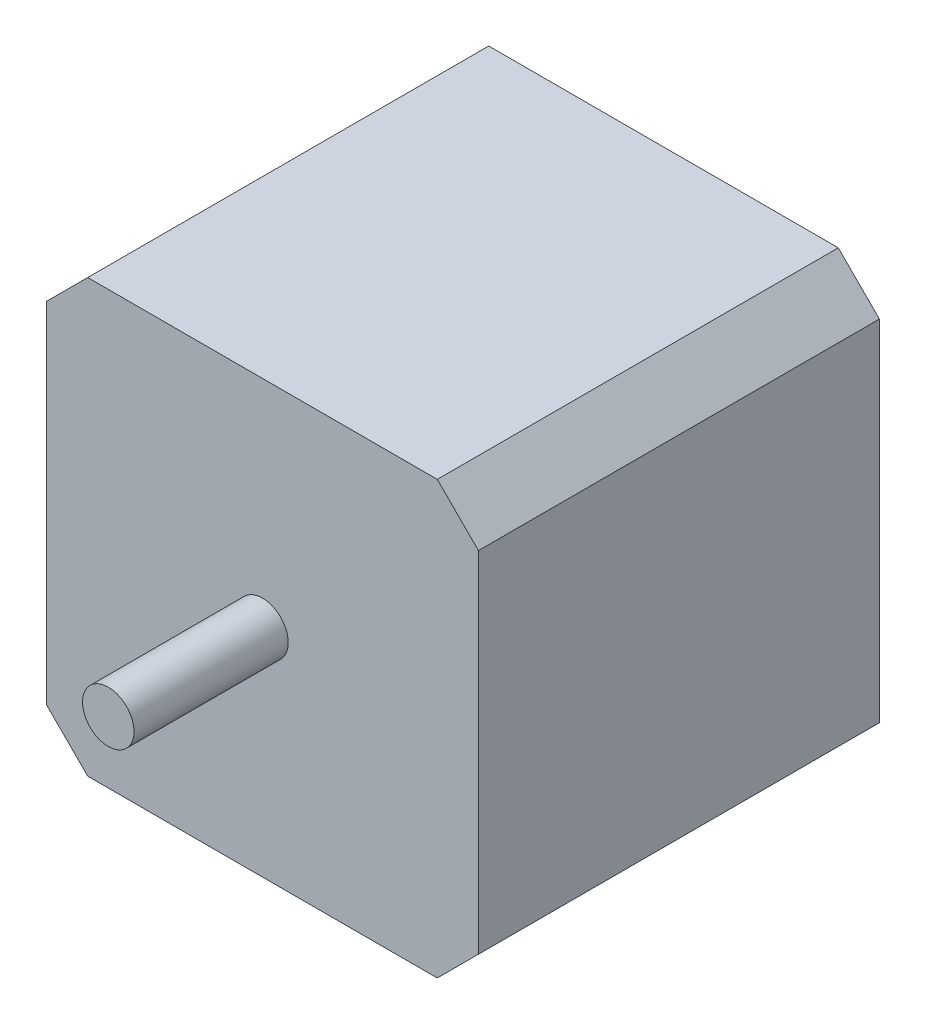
ISO-10303-21;
HEADER;
FILE_DESCRIPTION(('STEP AP214'),'2;1');
FILE_NAME('part.step','',(''),(''),'','','');
FILE_SCHEMA(('AUTOMOTIVE_DESIGN { 1 0 10303 214 1 1 1 1 }'));
ENDSEC;
DATA;
#1=APPLICATION_CONTEXT('core data for automotive mechanical design processes');
#2=APPLICATION_PROTOCOL_DEFINITION('international standard','automotive_design',2000,#1);
#3=PRODUCT_CONTEXT('',#1,'mechanical');
#4=PRODUCT('Part','Part','',(#3));
#5=PRODUCT_RELATED_PRODUCT_CATEGORY('part','',(#4));
#6=PRODUCT_DEFINITION_FORMATION('','',#4);
#7=PRODUCT_DEFINITION_CONTEXT('part definition',#1,'design');
#8=PRODUCT_DEFINITION('design','',#6,#7);
#9=PRODUCT_DEFINITION_SHAPE('','',#8);
#10=(LENGTH_UNIT() NAMED_UNIT(*) SI_UNIT(.MILLI.,.METRE.));
#11=(NAMED_UNIT(*) PLANE_ANGLE_UNIT() SI_UNIT($,.RADIAN.));
#12=(NAMED_UNIT(*) SI_UNIT($,.STERADIAN.) SOLID_ANGLE_UNIT());
#13=UNCERTAINTY_MEASURE_WITH_UNIT(LENGTH_MEASURE(1.E-05),#10,'distance_accuracy_value','');
#14=(GEOMETRIC_REPRESENTATION_CONTEXT(3) GLOBAL_UNCERTAINTY_ASSIGNED_CONTEXT((#13)) GLOBAL_UNIT_ASSIGNED_CONTEXT((#10,
#11,#12)) REPRESENTATION_CONTEXT('',''));
#15=CARTESIAN_POINT('',(0.,0.,0.));
#16=DIRECTION('',(0.,0.,1.));
#17=DIRECTION('',(1.,0.,0.));
#18=AXIS2_PLACEMENT_3D('',#15,#16,#17);
#19=CARTESIAN_POINT('',(0.,0.,39.));
#20=DIRECTION('',(1.,0.,0.));
#21=DIRECTION('',(0.,0.,-1.));
#22=AXIS2_PLACEMENT_3D('',#19,#20,#21);
#23=PLANE('',#22);
#24=DIRECTION('',(0.,-1.,0.));
#25=VECTOR('',#24,1.);
#26=CARTESIAN_POINT('',(0.,0.,0.));
#27=LINE('',#26,#25);
#28=CARTESIAN_POINT('',(0.,38.,0.));
#29=VERTEX_POINT('',#28);
#30=CARTESIAN_POINT('',(0.,4.00000000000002,0.));
#31=VERTEX_POINT('',#30);
#32=EDGE_CURVE('E140',#29,#31,#27,.T.);
#33=ORIENTED_EDGE('',*,*,#32,.T.);
#34=DIRECTION('',(0.,0.,1.));
#35=VECTOR('',#34,1.);
#36=CARTESIAN_POINT('',(0.,4.00000000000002,39.));
#37=LINE('',#36,#35);
#38=CARTESIAN_POINT('',(0.,4.00000000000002,39.));
#39=VERTEX_POINT('',#38);
#40=EDGE_CURVE('E178',#31,#39,#37,.T.);
#41=ORIENTED_EDGE('',*,*,#40,.T.);
#42=DIRECTION('',(0.,-1.,0.));
#43=VECTOR('',#42,1.);
#44=CARTESIAN_POINT('',(0.,0.,39.));
#45=LINE('',#44,#43);
#46=CARTESIAN_POINT('',(0.,38.,39.));
#47=VERTEX_POINT('',#46);
#48=EDGE_CURVE('E138',#47,#39,#45,.T.);
#49=ORIENTED_EDGE('',*,*,#48,.F.);
#50=DIRECTION('',(0.,0.,-1.));
#51=VECTOR('',#50,1.);
#52=CARTESIAN_POINT('',(0.,38.,39.));
#53=LINE('',#52,#51);
#54=EDGE_CURVE('E174',#47,#29,#53,.T.);
#55=ORIENTED_EDGE('',*,*,#54,.T.);
#56=EDGE_LOOP('',(#33,#41,#49,#55));
#57=FACE_BOUND('',#56,.T.);
#58=ADVANCED_FACE('F39',(#57),#23,.F.);
#59=CARTESIAN_POINT('',(0.,0.,39.));
#60=DIRECTION('',(0.,1.,0.));
#61=DIRECTION('',(0.,0.,1.));
#62=AXIS2_PLACEMENT_3D('',#59,#60,#61);
#63=PLANE('',#62);
#64=DIRECTION('',(1.,0.,0.));
#65=VECTOR('',#64,1.);
#66=CARTESIAN_POINT('',(0.,0.,0.));
#67=LINE('',#66,#65);
#68=CARTESIAN_POINT('',(4.,0.,0.));
#69=VERTEX_POINT('',#68);
#70=CARTESIAN_POINT('',(38.,0.,0.));
#71=VERTEX_POINT('',#70);
#72=EDGE_CURVE('E134',#69,#71,#67,.T.);
#73=ORIENTED_EDGE('',*,*,#72,.T.);
#74=DIRECTION('',(0.,0.,1.));
#75=VECTOR('',#74,1.);
#76=CARTESIAN_POINT('',(38.,0.,39.));
#77=LINE('',#76,#75);
#78=CARTESIAN_POINT('',(38.,0.,39.));
#79=VERTEX_POINT('',#78);
#80=EDGE_CURVE('E110',#71,#79,#77,.T.);
#81=ORIENTED_EDGE('',*,*,#80,.T.);
#82=DIRECTION('',(1.,0.,0.));
#83=VECTOR('',#82,1.);
#84=CARTESIAN_POINT('',(0.,0.,39.));
#85=LINE('',#84,#83);
#86=CARTESIAN_POINT('',(4.,0.,39.));
#87=VERTEX_POINT('',#86);
#88=EDGE_CURVE('E197',#87,#79,#85,.T.);
#89=ORIENTED_EDGE('',*,*,#88,.F.);
#90=DIRECTION('',(0.,0.,-1.));
#91=VECTOR('',#90,1.);
#92=CARTESIAN_POINT('',(4.,0.,39.));
#93=LINE('',#92,#91);
#94=EDGE_CURVE('E116',#87,#69,#93,.T.);
#95=ORIENTED_EDGE('',*,*,#94,.T.);
#96=EDGE_LOOP('',(#73,#81,#89,#95));
#97=FACE_BOUND('',#96,.T.);
#98=ADVANCED_FACE('F227',(#97),#63,.F.);
#99=CARTESIAN_POINT('',(42.,0.,39.));
#100=DIRECTION('',(-1.,0.,0.));
#101=DIRECTION('',(0.,0.,1.));
#102=AXIS2_PLACEMENT_3D('',#99,#100,#101);
#103=PLANE('',#102);
#104=DIRECTION('',(0.,1.,0.));
#105=VECTOR('',#104,1.);
#106=CARTESIAN_POINT('',(42.,0.,39.));
#107=LINE('',#106,#105);
#108=CARTESIAN_POINT('',(42.,4.,39.));
#109=VERTEX_POINT('',#108);
#110=CARTESIAN_POINT('',(42.,38.,39.));
#111=VERTEX_POINT('',#110);
#112=EDGE_CURVE('E125',#109,#111,#107,.T.);
#113=ORIENTED_EDGE('',*,*,#112,.F.);
#114=DIRECTION('',(0.,0.,-1.));
#115=VECTOR('',#114,1.);
#116=CARTESIAN_POINT('',(42.,4.,39.));
#117=LINE('',#116,#115);
#118=CARTESIAN_POINT('',(42.,4.,0.));
#119=VERTEX_POINT('',#118);
#120=EDGE_CURVE('E109',#109,#119,#117,.T.);
#121=ORIENTED_EDGE('',*,*,#120,.T.);
#122=DIRECTION('',(0.,1.,0.));
#123=VECTOR('',#122,1.);
#124=CARTESIAN_POINT('',(42.,0.,0.));
#125=LINE('',#124,#123);
#126=CARTESIAN_POINT('',(42.,38.,0.));
#127=VERTEX_POINT('',#126);
#128=EDGE_CURVE('E123',#119,#127,#125,.T.);
#129=ORIENTED_EDGE('',*,*,#128,.T.);
#130=DIRECTION('',(0.,0.,1.));
#131=VECTOR('',#130,1.);
#132=CARTESIAN_POINT('',(42.,38.,39.));
#133=LINE('',#132,#131);
#134=EDGE_CURVE('E128',#127,#111,#133,.T.);
#135=ORIENTED_EDGE('',*,*,#134,.T.);
#136=EDGE_LOOP('',(#113,#121,#129,#135));
#137=FACE_BOUND('',#136,.T.);
#138=ADVANCED_FACE('F122',(#137),#103,.F.);
#139=CARTESIAN_POINT('',(0.,42.,39.));
#140=DIRECTION('',(0.,-1.,0.));
#141=DIRECTION('',(0.,0.,-1.));
#142=AXIS2_PLACEMENT_3D('',#139,#140,#141);
#143=PLANE('',#142);
#144=DIRECTION('',(-1.,0.,0.));
#145=VECTOR('',#144,1.);
#146=CARTESIAN_POINT('',(0.,42.,0.));
#147=LINE('',#146,#145);
#148=CARTESIAN_POINT('',(38.,42.,0.));
#149=VERTEX_POINT('',#148);
#150=CARTESIAN_POINT('',(4.00000000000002,42.,0.));
#151=VERTEX_POINT('',#150);
#152=EDGE_CURVE('E133',#149,#151,#147,.T.);
#153=ORIENTED_EDGE('',*,*,#152,.T.);
#154=DIRECTION('',(0.,0.,1.));
#155=VECTOR('',#154,1.);
#156=CARTESIAN_POINT('',(4.00000000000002,42.,39.));
#157=LINE('',#156,#155);
#158=CARTESIAN_POINT('',(4.00000000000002,42.,39.));
#159=VERTEX_POINT('',#158);
#160=EDGE_CURVE('E11',#151,#159,#157,.T.);
#161=ORIENTED_EDGE('',*,*,#160,.T.);
#162=DIRECTION('',(-1.,0.,0.));
#163=VECTOR('',#162,1.);
#164=CARTESIAN_POINT('',(0.,42.,39.));
#165=LINE('',#164,#163);
#166=CARTESIAN_POINT('',(38.,42.,39.));
#167=VERTEX_POINT('',#166);
#168=EDGE_CURVE('E148',#167,#159,#165,.T.);
#169=ORIENTED_EDGE('',*,*,#168,.F.);
#170=DIRECTION('',(0.,0.,-1.));
#171=VECTOR('',#170,1.);
#172=CARTESIAN_POINT('',(38.,42.,39.));
#173=LINE('',#172,#171);
#174=EDGE_CURVE('E48',#167,#149,#173,.T.);
#175=ORIENTED_EDGE('',*,*,#174,.T.);
#176=EDGE_LOOP('',(#153,#161,#169,#175));
#177=FACE_BOUND('',#176,.T.);
#178=ADVANCED_FACE('F183',(#177),#143,.F.);
#179=CARTESIAN_POINT('',(0.,0.,39.));
#180=DIRECTION('',(0.,0.,-1.));
#181=DIRECTION('',(-1.,0.,0.));
#182=AXIS2_PLACEMENT_3D('',#179,#180,#181);
#183=PLANE('',#182);
#184=CARTESIAN_POINT('',(21.,21.,39.));
#185=DIRECTION('',(0.,0.,-1.));
#186=DIRECTION('',(-1.,0.,0.));
#187=AXIS2_PLACEMENT_3D('',#184,#185,#186);
#188=CIRCLE('',#187,2.5);
#189=CARTESIAN_POINT('',(18.5,21.,39.));
#190=VERTEX_POINT('',#189);
#191=EDGE_CURVE('E144',#190,#190,#188,.F.);
#192=ORIENTED_EDGE('',*,*,#191,.F.);
#193=EDGE_LOOP('',(#192));
#194=FACE_BOUND('',#193,.T.);
#195=ORIENTED_EDGE('',*,*,#88,.T.);
#196=DIRECTION('',(-0.707106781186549,-0.707106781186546,0.));
#197=VECTOR('',#196,1.);
#198=CARTESIAN_POINT('',(42.,4.,39.));
#199=LINE('',#198,#197);
#200=EDGE_CURVE('E171',#79,#109,#199,.F.);
#201=ORIENTED_EDGE('',*,*,#200,.T.);
#202=ORIENTED_EDGE('',*,*,#112,.T.);
#203=DIRECTION('',(0.707106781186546,-0.707106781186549,0.));
#204=VECTOR('',#203,1.);
#205=CARTESIAN_POINT('',(38.,42.,39.));
#206=LINE('',#205,#204);
#207=EDGE_CURVE('E60',#111,#167,#206,.F.);
#208=ORIENTED_EDGE('',*,*,#207,.T.);
#209=ORIENTED_EDGE('',*,*,#168,.T.);
#210=DIRECTION('',(0.707106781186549,0.707106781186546,0.));
#211=VECTOR('',#210,1.);
#212=CARTESIAN_POINT('',(0.,38.,39.));
#213=LINE('',#212,#211);
#214=EDGE_CURVE('E165',#159,#47,#213,.F.);
#215=ORIENTED_EDGE('',*,*,#214,.T.);
#216=ORIENTED_EDGE('',*,*,#48,.T.);
#217=DIRECTION('',(-0.707106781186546,0.707106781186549,0.));
#218=VECTOR('',#217,1.);
#219=CARTESIAN_POINT('',(4.,0.,39.));
#220=LINE('',#219,#218);
#221=EDGE_CURVE('E168',#39,#87,#220,.F.);
#222=ORIENTED_EDGE('',*,*,#221,.T.);
#223=EDGE_LOOP('',(#195,#201,#202,#208,#209,#215,#216,#222));
#224=FACE_BOUND('',#223,.T.);
#225=ADVANCED_FACE('F221',(#194,#224),#183,.F.);
#226=CARTESIAN_POINT('',(0.,0.,0.));
#227=DIRECTION('',(0.,0.,-1.));
#228=DIRECTION('',(-1.,0.,0.));
#229=AXIS2_PLACEMENT_3D('',#226,#227,#228);
#230=PLANE('',#229);
#231=ORIENTED_EDGE('',*,*,#128,.F.);
#232=DIRECTION('',(0.707106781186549,0.707106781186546,0.));
#233=VECTOR('',#232,1.);
#234=CARTESIAN_POINT('',(18.9999999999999,-19.,0.));
#235=LINE('',#234,#233);
#236=EDGE_CURVE('E105',#119,#71,#235,.F.);
#237=ORIENTED_EDGE('',*,*,#236,.T.);
#238=ORIENTED_EDGE('',*,*,#72,.F.);
#239=DIRECTION('',(0.707106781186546,-0.707106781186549,0.));
#240=VECTOR('',#239,1.);
#241=CARTESIAN_POINT('',(2.00000000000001,2.,0.));
#242=LINE('',#241,#240);
#243=EDGE_CURVE('E117',#69,#31,#242,.F.);
#244=ORIENTED_EDGE('',*,*,#243,.T.);
#245=ORIENTED_EDGE('',*,*,#32,.F.);
#246=DIRECTION('',(-0.707106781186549,-0.707106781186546,0.));
#247=VECTOR('',#246,1.);
#248=CARTESIAN_POINT('',(-19.,19.0000000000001,0.));
#249=LINE('',#248,#247);
#250=EDGE_CURVE('E153',#29,#151,#249,.F.);
#251=ORIENTED_EDGE('',*,*,#250,.T.);
#252=ORIENTED_EDGE('',*,*,#152,.F.);
#253=DIRECTION('',(-0.707106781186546,0.707106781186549,0.));
#254=VECTOR('',#253,1.);
#255=CARTESIAN_POINT('',(40.0000000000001,39.9999999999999,0.));
#256=LINE('',#255,#254);
#257=EDGE_CURVE('E127',#149,#127,#256,.F.);
#258=ORIENTED_EDGE('',*,*,#257,.T.);
#259=EDGE_LOOP('',(#231,#237,#238,#244,#245,#251,#252,#258));
#260=FACE_BOUND('',#259,.T.);
#261=ADVANCED_FACE('F130',(#260),#230,.T.);
#262=CARTESIAN_POINT('',(21.,21.,54.));
#263=DIRECTION('',(0.,0.,-1.));
#264=DIRECTION('',(-1.,0.,0.));
#265=AXIS2_PLACEMENT_3D('',#262,#263,#264);
#266=CYLINDRICAL_SURFACE('',#265,2.5);
#267=CARTESIAN_POINT('',(21.,21.,54.));
#268=DIRECTION('',(0.,0.,1.));
#269=DIRECTION('',(1.,0.,0.));
#270=AXIS2_PLACEMENT_3D('',#267,#268,#269);
#271=CIRCLE('',#270,2.5);
#272=CARTESIAN_POINT('',(23.5,21.,54.));
#273=VERTEX_POINT('',#272);
#274=EDGE_CURVE('E203',#273,#273,#271,.T.);
#275=ORIENTED_EDGE('',*,*,#274,.F.);
#276=EDGE_LOOP('',(#275));
#277=FACE_BOUND('',#276,.T.);
#278=ORIENTED_EDGE('',*,*,#191,.T.);
#279=EDGE_LOOP('',(#278));
#280=FACE_BOUND('',#279,.T.);
#281=ADVANCED_FACE('F215',(#277,#280),#266,.T.);
#282=CARTESIAN_POINT('',(21.,21.,54.));
#283=DIRECTION('',(0.,0.,1.));
#284=DIRECTION('',(1.,0.,0.));
#285=AXIS2_PLACEMENT_3D('',#282,#283,#284);
#286=PLANE('',#285);
#287=ORIENTED_EDGE('',*,*,#274,.T.);
#288=EDGE_LOOP('',(#287));
#289=FACE_BOUND('',#288,.T.);
#290=ADVANCED_FACE('F213',(#289),#286,.T.);
#291=CARTESIAN_POINT('',(42.,4.,39.));
#292=DIRECTION('',(-0.707106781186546,0.707106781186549,0.));
#293=DIRECTION('',(0.,0.,-1.));
#294=AXIS2_PLACEMENT_3D('',#291,#292,#293);
#295=PLANE('',#294);
#296=ORIENTED_EDGE('',*,*,#200,.F.);
#297=ORIENTED_EDGE('',*,*,#80,.F.);
#298=ORIENTED_EDGE('',*,*,#236,.F.);
#299=ORIENTED_EDGE('',*,*,#120,.F.);
#300=EDGE_LOOP('',(#296,#297,#298,#299));
#301=FACE_BOUND('',#300,.T.);
#302=ADVANCED_FACE('F108',(#301),#295,.F.);
#303=CARTESIAN_POINT('',(4.,0.,39.));
#304=DIRECTION('',(0.707106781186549,0.707106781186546,0.));
#305=DIRECTION('',(0.,0.,-1.));
#306=AXIS2_PLACEMENT_3D('',#303,#304,#305);
#307=PLANE('',#306);
#308=ORIENTED_EDGE('',*,*,#221,.F.);
#309=ORIENTED_EDGE('',*,*,#40,.F.);
#310=ORIENTED_EDGE('',*,*,#243,.F.);
#311=ORIENTED_EDGE('',*,*,#94,.F.);
#312=EDGE_LOOP('',(#308,#309,#310,#311));
#313=FACE_BOUND('',#312,.T.);
#314=ADVANCED_FACE('F229',(#313),#307,.F.);
#315=CARTESIAN_POINT('',(0.,38.,39.));
#316=DIRECTION('',(0.707106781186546,-0.707106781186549,0.));
#317=DIRECTION('',(0.,0.,-1.));
#318=AXIS2_PLACEMENT_3D('',#315,#316,#317);
#319=PLANE('',#318);
#320=ORIENTED_EDGE('',*,*,#214,.F.);
#321=ORIENTED_EDGE('',*,*,#160,.F.);
#322=ORIENTED_EDGE('',*,*,#250,.F.);
#323=ORIENTED_EDGE('',*,*,#54,.F.);
#324=EDGE_LOOP('',(#320,#321,#322,#323));
#325=FACE_BOUND('',#324,.T.);
#326=ADVANCED_FACE('F190',(#325),#319,.F.);
#327=CARTESIAN_POINT('',(38.,42.,39.));
#328=DIRECTION('',(-0.707106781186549,-0.707106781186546,0.));
#329=DIRECTION('',(0.,0.,-1.));
#330=AXIS2_PLACEMENT_3D('',#327,#328,#329);
#331=PLANE('',#330);
#332=ORIENTED_EDGE('',*,*,#207,.F.);
#333=ORIENTED_EDGE('',*,*,#134,.F.);
#334=ORIENTED_EDGE('',*,*,#257,.F.);
#335=ORIENTED_EDGE('',*,*,#174,.F.);
#336=EDGE_LOOP('',(#332,#333,#334,#335));
#337=FACE_BOUND('',#336,.T.);
#338=ADVANCED_FACE('F41',(#337),#331,.F.);
#339=CLOSED_SHELL('',(#58,#98,#138,#178,#225,#261,#281,#290,#302,#314,#326,#338));
#340=MANIFOLD_SOLID_BREP('B2',#339);
#341=ADVANCED_BREP_SHAPE_REPRESENTATION('',(#18,#340),#14);
#342=SHAPE_DEFINITION_REPRESENTATION(#9,#341);
ENDSEC;
END-ISO-10303-21;
